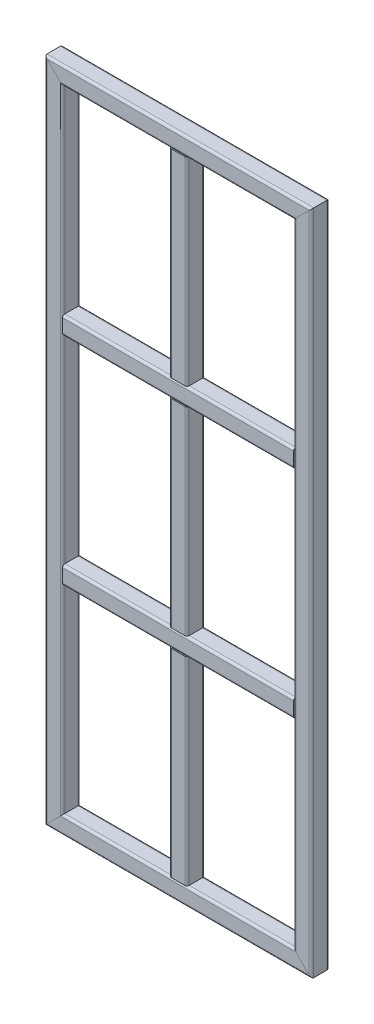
from build123d import *

# Parameters (mm, degrees)
CZ_ON_KONSTRUKCYJNY1_DEPTH      = 1177.568542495
CZ_ON_KONSTRUKCYJNY1_DEPTH_BACK = 57.568542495
CZ_ON_KONSTRUKCYJNY1_2_DEPTH    = 3035.13708499
CZ_ON_KONSTRUKCYJNY1_3_DEPTH    = 1235.13708499
CZ_ON_KONSTRUKCYJNY1_4_DEPTH    = 3035.13708499
CZ_ON_KONSTRUKCYJNY1_5_DEPTH    = 1122
CZ_ON_KONSTRUKCYJNY1_6_DEPTH    = 1122
CZ_ON_KONSTRUKCYJNY1_7_DEPTH    = 975.333333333
CZ_ON_KONSTRUKCYJNY1_8_DEPTH    = 975.333333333
CZ_ON_KONSTRUKCYJNY1_9_DEPTH    = 975.333333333


with BuildPart() as part:
    # Sketch1 → Cz_on konstrukcyjny1 (new, two sides: drawn at the far end of the back side and taken through both)
    with BuildSketch(Plane(origin=(-80, 1460, 0), x_dir=(0, -1, 0), z_dir=(-1, 0, 0)).offset(-CZ_ON_KONSTRUKCYJNY1_DEPTH_BACK)):
        with BuildLine():
            Line((-30, -40), (30, -40))
            ThreePointArc((30, -40), (37.071067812, -37.071067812), (40, -30))
            Line((40, -30), (40, 30))
            ThreePointArc((40, 30), (37.071067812, 37.071067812), (30, 40))
            Line((30, 40), (-30, 40))
            ThreePointArc((-30, 40), (-37.071067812, 37.071067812), (-40, 30))
            Line((-40, 30), (-40, -30))
            ThreePointArc((-40, -30), (-37.071067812, -37.071067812), (-30, -40))
        make_face()
        with BuildLine():
            Line((-30, -35), (30, -35))
            ThreePointArc((30, -35), (33.535533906, -33.535533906), (35, -30))
            Line((35, -30), (35, 30))
            ThreePointArc((35, 30), (33.535533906, 33.535533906), (30, 35))
            Line((30, 35), (-30, 35))
            ThreePointArc((-30, 35), (-33.535533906, 33.535533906), (-35, 30))
            Line((-35, 30), (-35, -30))
            ThreePointArc((-35, -30), (-33.535533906, -33.535533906), (-30, -35))
        make_face(mode=Mode.SUBTRACT)
    extrude(amount=CZ_ON_KONSTRUKCYJNY1_DEPTH + CZ_ON_KONSTRUKCYJNY1_DEPTH_BACK)

    # Cz_on konstrukcyjny1 mitre 1
    split(bisect_by=Plane(origin=(-80, 1460, 0), x_dir=(-0.707106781, -0.707106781, 0), z_dir=(-0.707106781, 0.707106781, 0)), keep=Keep.TOP)

    # Cz_on konstrukcyjny1 mitre 2
    split(bisect_by=Plane(origin=(-1200, 1460, 0), x_dir=(-0.707106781, 0.707106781, 0), z_dir=(0.707106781, 0.707106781, 0)), keep=Keep.TOP)


with BuildPart() as body_2:
    # Sketch1 on segment 2 (on carried to segment 2) → Cz_on konstrukcyjny1 2 (new body)
    with BuildSketch(Plane(origin=(-1200, 1517.568542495, 0), x_dir=(1, 0, 0), z_dir=(0, -1, 0))):
        with BuildLine():
            Line((-30, -40), (30, -40))
            ThreePointArc((30, -40), (37.071067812, -37.071067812), (40, -30))
            Line((40, -30), (40, 30))
            ThreePointArc((40, 30), (37.071067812, 37.071067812), (30, 40))
            Line((30, 40), (-30, 40))
            ThreePointArc((-30, 40), (-37.071067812, 37.071067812), (-40, 30))
            Line((-40, 30), (-40, -30))
            ThreePointArc((-40, -30), (-37.071067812, -37.071067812), (-30, -40))
        make_face()
        with BuildLine():
            Line((-30, -35), (30, -35))
            ThreePointArc((30, -35), (33.535533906, -33.535533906), (35, -30))
            Line((35, -30), (35, 30))
            ThreePointArc((35, 30), (33.535533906, 33.535533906), (30, 35))
            Line((30, 35), (-30, 35))
            ThreePointArc((-30, 35), (-33.535533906, 33.535533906), (-35, 30))
            Line((-35, 30), (-35, -30))
            ThreePointArc((-35, -30), (-33.535533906, -33.535533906), (-30, -35))
        make_face(mode=Mode.SUBTRACT)
    extrude(amount=CZ_ON_KONSTRUKCYJNY1_2_DEPTH)

    # Cz_on konstrukcyjny1 2 mitre 1
    split(bisect_by=Plane(origin=(-1200, -1460, 0), x_dir=(-0.707106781, -0.707106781, 0), z_dir=(-0.707106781, 0.707106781, 0)), keep=Keep.TOP)

    # Cz_on konstrukcyjny1 2 mitre 2
    split(bisect_by=Plane(origin=(-1200, 1460, 0), x_dir=(0.707106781, -0.707106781, 0), z_dir=(-0.707106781, -0.707106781, 0)), keep=Keep.TOP)


with BuildPart() as body_3:
    # Sketch1 on segment 3 (on carried to segment 3) → Cz_on konstrukcyjny1 3 (new body)
    with BuildSketch(Plane(origin=(-1257.568542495, -1460, 0), x_dir=(0, 1, 0), z_dir=(1, 0, 0))):
        with BuildLine():
            Line((-30, -40), (30, -40))
            ThreePointArc((30, -40), (37.071067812, -37.071067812), (40, -30))
            Line((40, -30), (40, 30))
            ThreePointArc((40, 30), (37.071067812, 37.071067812), (30, 40))
            Line((30, 40), (-30, 40))
            ThreePointArc((-30, 40), (-37.071067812, 37.071067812), (-40, 30))
            Line((-40, 30), (-40, -30))
            ThreePointArc((-40, -30), (-37.071067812, -37.071067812), (-30, -40))
        make_face()
        with BuildLine():
            Line((-30, -35), (30, -35))
            ThreePointArc((30, -35), (33.535533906, -33.535533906), (35, -30))
            Line((35, -30), (35, 30))
            ThreePointArc((35, 30), (33.535533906, 33.535533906), (30, 35))
            Line((30, 35), (-30, 35))
            ThreePointArc((-30, 35), (-33.535533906, 33.535533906), (-35, 30))
            Line((-35, 30), (-35, -30))
            ThreePointArc((-35, -30), (-33.535533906, -33.535533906), (-30, -35))
        make_face(mode=Mode.SUBTRACT)
    extrude(amount=CZ_ON_KONSTRUKCYJNY1_3_DEPTH)

    # Cz_on konstrukcyjny1 3 mitre 1
    split(bisect_by=Plane(origin=(-80, -1460, 0), x_dir=(0.707106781, -0.707106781, 0), z_dir=(-0.707106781, -0.707106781, 0)), keep=Keep.TOP)

    # Cz_on konstrukcyjny1 3 mitre 2
    split(bisect_by=Plane(origin=(-1200, -1460, 0), x_dir=(0.707106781, 0.707106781, 0), z_dir=(0.707106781, -0.707106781, 0)), keep=Keep.TOP)


with BuildPart() as body_4:
    # Sketch1 on segment 4 (on carried to segment 4) → Cz_on konstrukcyjny1 4 (new body)
    with BuildSketch(Plane(origin=(-80, -1517.568542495, 0), x_dir=(-1, 0, 0), z_dir=(0, 1, 0))):
        with BuildLine():
            Line((-30, -40), (30, -40))
            ThreePointArc((30, -40), (37.071067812, -37.071067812), (40, -30))
            Line((40, -30), (40, 30))
            ThreePointArc((40, 30), (37.071067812, 37.071067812), (30, 40))
            Line((30, 40), (-30, 40))
            ThreePointArc((-30, 40), (-37.071067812, 37.071067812), (-40, 30))
            Line((-40, 30), (-40, -30))
            ThreePointArc((-40, -30), (-37.071067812, -37.071067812), (-30, -40))
        make_face()
        with BuildLine():
            Line((-30, -35), (30, -35))
            ThreePointArc((30, -35), (33.535533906, -33.535533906), (35, -30))
            Line((35, -30), (35, 30))
            ThreePointArc((35, 30), (33.535533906, 33.535533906), (30, 35))
            Line((30, 35), (-30, 35))
            ThreePointArc((-30, 35), (-33.535533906, 33.535533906), (-35, 30))
            Line((-35, 30), (-35, -30))
            ThreePointArc((-35, -30), (-33.535533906, -33.535533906), (-30, -35))
        make_face(mode=Mode.SUBTRACT)
    extrude(amount=CZ_ON_KONSTRUKCYJNY1_4_DEPTH)

    # Cz_on konstrukcyjny1 4 mitre 1
    split(bisect_by=Plane(origin=(-80, -1460, 0), x_dir=(-0.707106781, 0.707106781, 0), z_dir=(0.707106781, 0.707106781, 0)), keep=Keep.TOP)

    # Cz_on konstrukcyjny1 4 mitre 2
    split(bisect_by=Plane(origin=(-80, 1460, 0), x_dir=(0.707106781, 0.707106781, 0), z_dir=(0.707106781, -0.707106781, 0)), keep=Keep.TOP)


with BuildPart() as body_5:
    # Sketch1 on segment 5 (on carried to segment 5) → Cz_on konstrukcyjny1 5 (new body)
    with BuildSketch(Plane(origin=(-1201, 486.666666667, 0), x_dir=(0, 1, 0), z_dir=(1, 0, 0))):
        with BuildLine():
            Line((-30, -40), (30, -40))
            ThreePointArc((30, -40), (37.071067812, -37.071067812), (40, -30))
            Line((40, -30), (40, 30))
            ThreePointArc((40, 30), (37.071067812, 37.071067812), (30, 40))
            Line((30, 40), (-30, 40))
            ThreePointArc((-30, 40), (-37.071067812, 37.071067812), (-40, 30))
            Line((-40, 30), (-40, -30))
            ThreePointArc((-40, -30), (-37.071067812, -37.071067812), (-30, -40))
        make_face()
        with BuildLine():
            Line((-30, -35), (30, -35))
            ThreePointArc((30, -35), (33.535533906, -33.535533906), (35, -30))
            Line((35, -30), (35, 30))
            ThreePointArc((35, 30), (33.535533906, 33.535533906), (30, 35))
            Line((30, 35), (-30, 35))
            ThreePointArc((-30, 35), (-33.535533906, 33.535533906), (-35, 30))
            Line((-35, 30), (-35, -30))
            ThreePointArc((-35, -30), (-33.535533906, -33.535533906), (-30, -35))
        make_face(mode=Mode.SUBTRACT)
    extrude(amount=CZ_ON_KONSTRUKCYJNY1_5_DEPTH)

    # Cz_on konstrukcyjny1 5 mitre 1
    split(bisect_by=Plane(origin=(-1160, 486.666666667, 0), x_dir=(0, 1, 0), z_dir=(1, 0, 0)), keep=Keep.TOP)

    # Cz_on konstrukcyjny1 5 mitre 2
    split(bisect_by=Plane(origin=(-120, 486.666666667, 0), x_dir=(0, -1, 0), z_dir=(-1, 0, 0)), keep=Keep.TOP)


with BuildPart() as body_6:
    # Sketch1 on segment 6 (on carried to segment 6) → Cz_on konstrukcyjny1 6 (new body)
    with BuildSketch(Plane(origin=(-1201, -486.666666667, 0), x_dir=(0, 1, 0), z_dir=(1, 0, 0))):
        with BuildLine():
            Line((-30, -40), (30, -40))
            ThreePointArc((30, -40), (37.071067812, -37.071067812), (40, -30))
            Line((40, -30), (40, 30))
            ThreePointArc((40, 30), (37.071067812, 37.071067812), (30, 40))
            Line((30, 40), (-30, 40))
            ThreePointArc((-30, 40), (-37.071067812, 37.071067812), (-40, 30))
            Line((-40, 30), (-40, -30))
            ThreePointArc((-40, -30), (-37.071067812, -37.071067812), (-30, -40))
        make_face()
        with BuildLine():
            Line((-30, -35), (30, -35))
            ThreePointArc((30, -35), (33.535533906, -33.535533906), (35, -30))
            Line((35, -30), (35, 30))
            ThreePointArc((35, 30), (33.535533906, 33.535533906), (30, 35))
            Line((30, 35), (-30, 35))
            ThreePointArc((-30, 35), (-33.535533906, 33.535533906), (-35, 30))
            Line((-35, 30), (-35, -30))
            ThreePointArc((-35, -30), (-33.535533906, -33.535533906), (-30, -35))
        make_face(mode=Mode.SUBTRACT)
    extrude(amount=CZ_ON_KONSTRUKCYJNY1_6_DEPTH)

    # Cz_on konstrukcyjny1 6 mitre 1
    split(bisect_by=Plane(origin=(-1160, -486.666666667, 0), x_dir=(0, 1, 0), z_dir=(1, 0, 0)), keep=Keep.TOP)

    # Cz_on konstrukcyjny1 6 mitre 2
    split(bisect_by=Plane(origin=(-120, -486.666666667, 0), x_dir=(0, -1, 0), z_dir=(-1, 0, 0)), keep=Keep.TOP)


with BuildPart() as body_7:
    # Sketch1 on segment 7 (on carried to segment 7) → Cz_on konstrukcyjny1 7 (new body)
    with BuildSketch(Plane(origin=(-640, 1461, 0), x_dir=(1, 0, 0), z_dir=(0, -1, 0))):
        with BuildLine():
            Line((-30, -40), (30, -40))
            ThreePointArc((30, -40), (37.071067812, -37.071067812), (40, -30))
            Line((40, -30), (40, 30))
            ThreePointArc((40, 30), (37.071067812, 37.071067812), (30, 40))
            Line((30, 40), (-30, 40))
            ThreePointArc((-30, 40), (-37.071067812, 37.071067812), (-40, 30))
            Line((-40, 30), (-40, -30))
            ThreePointArc((-40, -30), (-37.071067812, -37.071067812), (-30, -40))
        make_face()
        with BuildLine():
            Line((-30, -35), (30, -35))
            ThreePointArc((30, -35), (33.535533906, -33.535533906), (35, -30))
            Line((35, -30), (35, 30))
            ThreePointArc((35, 30), (33.535533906, 33.535533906), (30, 35))
            Line((30, 35), (-30, 35))
            ThreePointArc((-30, 35), (-33.535533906, 33.535533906), (-35, 30))
            Line((-35, 30), (-35, -30))
            ThreePointArc((-35, -30), (-33.535533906, -33.535533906), (-30, -35))
        make_face(mode=Mode.SUBTRACT)
    extrude(amount=CZ_ON_KONSTRUKCYJNY1_7_DEPTH)

    # Cz_on konstrukcyjny1 7 mitre 1
    split(bisect_by=Plane(origin=(-640, 486.666666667, 0), x_dir=(-1, 0, 0), z_dir=(0, 1, 0)), keep=Keep.TOP)

    # Cz_on konstrukcyjny1 7 mitre 2
    split(bisect_by=Plane(origin=(-640, 1420, 0), x_dir=(1, 0, 0), z_dir=(0, -1, 0)), keep=Keep.TOP)

    # Cz_on konstrukcyjny1 7 mitre 3
    split(bisect_by=Plane(origin=(-640, 526.666666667, 0), x_dir=(-1, 0, 0), z_dir=(0, 1, 0)), keep=Keep.TOP)


with BuildPart() as body_8:
    # Sketch1 on segment 8 (on carried to segment 8) → Cz_on konstrukcyjny1 8 (new body)
    with BuildSketch(Plane(origin=(-640, 487.666666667, 0), x_dir=(1, 0, 0), z_dir=(0, -1, 0))):
        with BuildLine():
            Line((-30, -40), (30, -40))
            ThreePointArc((30, -40), (37.071067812, -37.071067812), (40, -30))
            Line((40, -30), (40, 30))
            ThreePointArc((40, 30), (37.071067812, 37.071067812), (30, 40))
            Line((30, 40), (-30, 40))
            ThreePointArc((-30, 40), (-37.071067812, 37.071067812), (-40, 30))
            Line((-40, 30), (-40, -30))
            ThreePointArc((-40, -30), (-37.071067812, -37.071067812), (-30, -40))
        make_face()
        with BuildLine():
            Line((-30, -35), (30, -35))
            ThreePointArc((30, -35), (33.535533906, -33.535533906), (35, -30))
            Line((35, -30), (35, 30))
            ThreePointArc((35, 30), (33.535533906, 33.535533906), (30, 35))
            Line((30, 35), (-30, 35))
            ThreePointArc((-30, 35), (-33.535533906, 33.535533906), (-35, 30))
            Line((-35, 30), (-35, -30))
            ThreePointArc((-35, -30), (-33.535533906, -33.535533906), (-30, -35))
        make_face(mode=Mode.SUBTRACT)
    extrude(amount=CZ_ON_KONSTRUKCYJNY1_8_DEPTH)

    # Cz_on konstrukcyjny1 8 mitre 1
    split(bisect_by=Plane(origin=(-640, 486.666666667, 0), x_dir=(1, 0, 0), z_dir=(0, -1, 0)), keep=Keep.TOP)

    # Cz_on konstrukcyjny1 8 mitre 2
    split(bisect_by=Plane(origin=(-640, -486.666666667, 0), x_dir=(-1, 0, 0), z_dir=(0, 1, 0)), keep=Keep.TOP)

    # Cz_on konstrukcyjny1 8 mitre 3
    split(bisect_by=Plane(origin=(-640, 446.666666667, 0), x_dir=(1, 0, 0), z_dir=(0, -1, 0)), keep=Keep.TOP)

    # Cz_on konstrukcyjny1 8 mitre 4
    split(bisect_by=Plane(origin=(-640, -446.666666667, 0), x_dir=(-1, 0, 0), z_dir=(0, 1, 0)), keep=Keep.TOP)


with BuildPart() as body_9:
    # Sketch1 on segment 9 (on carried to segment 9) → Cz_on konstrukcyjny1 9 (new body)
    with BuildSketch(Plane(origin=(-640, -485.666666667, 0), x_dir=(1, 0, 0), z_dir=(0, -1, 0))):
        with BuildLine():
            Line((-30, -40), (30, -40))
            ThreePointArc((30, -40), (37.071067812, -37.071067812), (40, -30))
            Line((40, -30), (40, 30))
            ThreePointArc((40, 30), (37.071067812, 37.071067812), (30, 40))
            Line((30, 40), (-30, 40))
            ThreePointArc((-30, 40), (-37.071067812, 37.071067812), (-40, 30))
            Line((-40, 30), (-40, -30))
            ThreePointArc((-40, -30), (-37.071067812, -37.071067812), (-30, -40))
        make_face()
        with BuildLine():
            Line((-30, -35), (30, -35))
            ThreePointArc((30, -35), (33.535533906, -33.535533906), (35, -30))
            Line((35, -30), (35, 30))
            ThreePointArc((35, 30), (33.535533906, 33.535533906), (30, 35))
            Line((30, 35), (-30, 35))
            ThreePointArc((-30, 35), (-33.535533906, 33.535533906), (-35, 30))
            Line((-35, 30), (-35, -30))
            ThreePointArc((-35, -30), (-33.535533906, -33.535533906), (-30, -35))
        make_face(mode=Mode.SUBTRACT)
    extrude(amount=CZ_ON_KONSTRUKCYJNY1_9_DEPTH)

    # Cz_on konstrukcyjny1 9 mitre 1
    split(bisect_by=Plane(origin=(-640, -486.666666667, 0), x_dir=(1, 0, 0), z_dir=(0, -1, 0)), keep=Keep.TOP)

    # Cz_on konstrukcyjny1 9 mitre 2
    split(bisect_by=Plane(origin=(-640, -526.666666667, 0), x_dir=(1, 0, 0), z_dir=(0, -1, 0)), keep=Keep.TOP)

    # Cz_on konstrukcyjny1 9 mitre 3
    split(bisect_by=Plane(origin=(-640, -1420, 0), x_dir=(-1, 0, 0), z_dir=(0, 1, 0)), keep=Keep.TOP)


solid = Compound([part.part, body_2.part, body_3.part, body_4.part, body_5.part, body_6.part, body_7.part, body_8.part, body_9.part])
